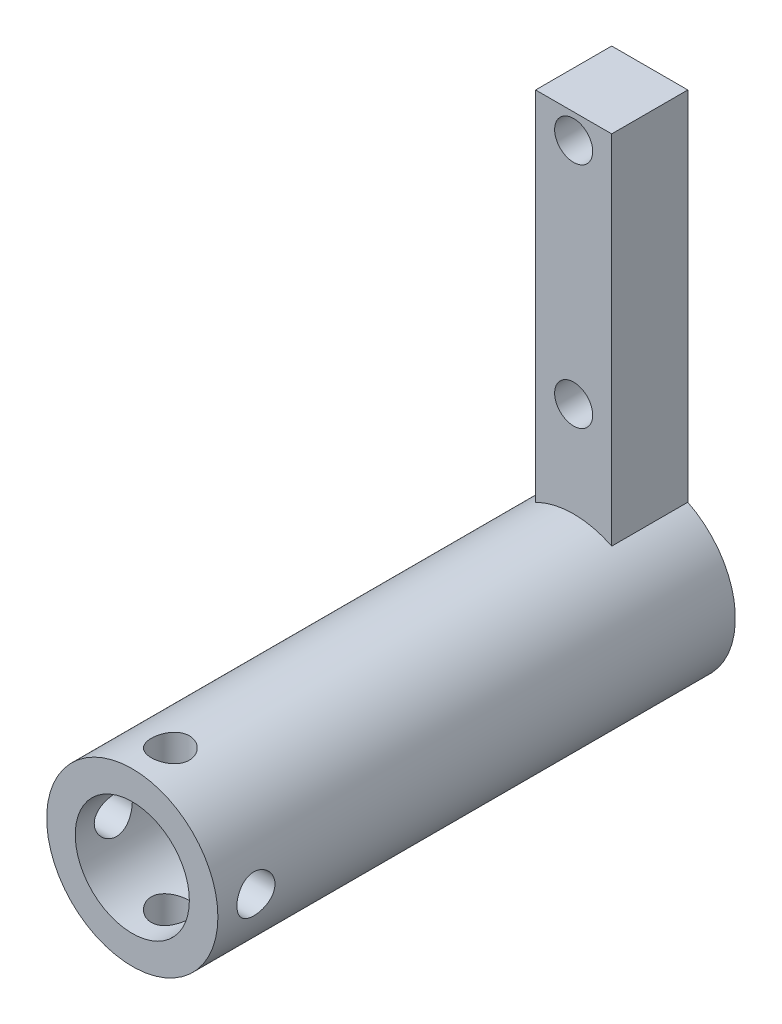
from build123d import *

# Parameters (mm, degrees)
BASE_EXTRUSION_DEPTH         = 10
BASE_EXTRUSION_DEPTH_BACK    = 126
ESQUISSE1_R                  = 22.5
ESQUISSE1_R_2                = 15
ENL_V_MAT_EXTRU_1_DEPTH      = 130.955761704
ENL_V_MAT_EXTRU_1_DEPTH_BACK = 130.955761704
ESQUISSE2_R                  = 5
ENL_V_MAT_EXTRU_2_DEPTH      = 130.955761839
ENL_V_MAT_EXTRU_2_DEPTH_BACK = 130.955761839
ESQUISSE3_R                  = 5
ESQUISSE4_W                  = 20
ESQUISSE4_H                  = 94
BOSS_EXTRU_2_DEPTH           = 20
ESQUISSE5_R                  = 5
ENL_V_MAT_EXTRU_3_DEPTH      = 179.880546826


with BuildPart() as part:
    # Esquisse1 → Base-Extrusion (new, two sides: drawn at the far end of the back side and taken through both)
    with BuildSketch(Plane.XY.offset(-BASE_EXTRUSION_DEPTH_BACK)):
        with Locations(Location((0, 0, 0), (0, 0, 116.387799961))):
            Circle(ESQUISSE1_R)
        Circle(ESQUISSE1_R_2, mode=Mode.SUBTRACT)
    extrude(amount=BASE_EXTRUSION_DEPTH + BASE_EXTRUSION_DEPTH_BACK)

    # Esquisse2 → Enl_v. mat.-Extru.1 (cut, two sides: drawn at the far end of the back side and taken through both)
    with BuildSketch(Plane(origin=(0, 0, 0), x_dir=(0, 0, -1), z_dir=(1, 0, 0)).offset(-ENL_V_MAT_EXTRU_1_DEPTH_BACK)):
        Circle(ESQUISSE2_R)
    extrude(amount=ENL_V_MAT_EXTRU_1_DEPTH + ENL_V_MAT_EXTRU_1_DEPTH_BACK, mode=Mode.SUBTRACT)

    # Esquisse3 → Enl_v. mat.-Extru.2 (cut, two sides: drawn at the far end of the back side and taken through both)
    with BuildSketch(Plane(origin=(0, 0, 0), x_dir=(1, 0, 0), z_dir=(0, 1, 0)).offset(-ENL_V_MAT_EXTRU_2_DEPTH_BACK)):
        with Locations(Location((0, 0, 0), (0, 0, 270))):
            Circle(ESQUISSE3_R)
    extrude(amount=ENL_V_MAT_EXTRU_2_DEPTH + ENL_V_MAT_EXTRU_2_DEPTH_BACK, mode=Mode.SUBTRACT)

    # Esquisse4 → Boss.-Extru.2 (add)
    with BuildSketch(Plane(origin=(0, 0, -126), x_dir=(-1, 0, 0), z_dir=(0, 0, -1))):
        with Locations((0, 67)):
            Rectangle(ESQUISSE4_W, ESQUISSE4_H)
    extrude(amount=-BOSS_EXTRU_2_DEPTH)

    # Esquisse5 → Enl_v. mat.-Extru.3 (cut, through all)
    with BuildSketch(Plane(origin=(0, 0, -126), x_dir=(-1, 0, 0), z_dir=(0, 0, -1))):
        with Locations((0, 107.5)):
            Circle(ESQUISSE5_R)
        with Locations((0, 47.5)):
            Circle(ESQUISSE5_R)
    extrude(amount=-ENL_V_MAT_EXTRU_3_DEPTH, mode=Mode.SUBTRACT)


solid = part.part
